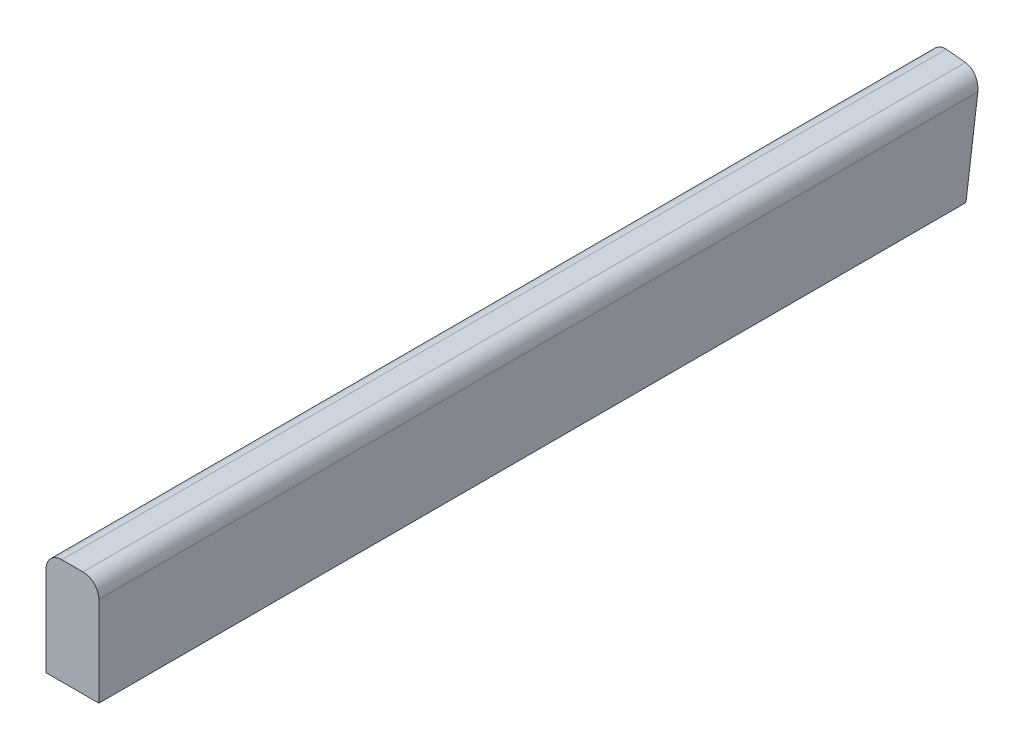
ISO-10303-21;
HEADER;
FILE_DESCRIPTION(('STEP AP214'),'2;1');
FILE_NAME('part.step','',(''),(''),'','','');
FILE_SCHEMA(('AUTOMOTIVE_DESIGN { 1 0 10303 214 1 1 1 1 }'));
ENDSEC;
DATA;
#1=APPLICATION_CONTEXT('core data for automotive mechanical design processes');
#2=APPLICATION_PROTOCOL_DEFINITION('international standard','automotive_design',2000,#1);
#3=PRODUCT_CONTEXT('',#1,'mechanical');
#4=PRODUCT('Part','Part','',(#3));
#5=PRODUCT_RELATED_PRODUCT_CATEGORY('part','',(#4));
#6=PRODUCT_DEFINITION_FORMATION('','',#4);
#7=PRODUCT_DEFINITION_CONTEXT('part definition',#1,'design');
#8=PRODUCT_DEFINITION('design','',#6,#7);
#9=PRODUCT_DEFINITION_SHAPE('','',#8);
#10=(LENGTH_UNIT() NAMED_UNIT(*) SI_UNIT(.MILLI.,.METRE.));
#11=(NAMED_UNIT(*) PLANE_ANGLE_UNIT() SI_UNIT($,.RADIAN.));
#12=(NAMED_UNIT(*) SI_UNIT($,.STERADIAN.) SOLID_ANGLE_UNIT());
#13=UNCERTAINTY_MEASURE_WITH_UNIT(LENGTH_MEASURE(1.E-05),#10,'distance_accuracy_value','');
#14=(GEOMETRIC_REPRESENTATION_CONTEXT(3) GLOBAL_UNCERTAINTY_ASSIGNED_CONTEXT((#13)) GLOBAL_UNIT_ASSIGNED_CONTEXT((#10,
#11,#12)) REPRESENTATION_CONTEXT('',''));
#15=CARTESIAN_POINT('',(0.,0.,0.));
#16=DIRECTION('',(0.,0.,1.));
#17=DIRECTION('',(1.,0.,0.));
#18=AXIS2_PLACEMENT_3D('',#15,#16,#17);
#19=CARTESIAN_POINT('',(0.,0.,-188.257777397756));
#20=DIRECTION('',(-1.,0.,0.));
#21=DIRECTION('',(0.,0.,1.));
#22=AXIS2_PLACEMENT_3D('',#19,#20,#21);
#23=PLANE('',#22);
#24=DIRECTION('',(0.,0.99138022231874,-0.13101623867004));
#25=VECTOR('',#24,1.);
#26=CARTESIAN_POINT('',(0.,3.03731969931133,-165.274834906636));
#27=LINE('',#26,#25);
#28=CARTESIAN_POINT('',(0.,0.,-164.873436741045));
#29=VERTEX_POINT('',#28);
#30=CARTESIAN_POINT('',(0.,17.,-167.120078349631));
#31=VERTEX_POINT('',#30);
#32=EDGE_CURVE('E41',#29,#31,#27,.T.);
#33=ORIENTED_EDGE('',*,*,#32,.F.);
#34=DIRECTION('',(0.,0.,1.));
#35=VECTOR('',#34,1.);
#36=CARTESIAN_POINT('',(0.,0.,-188.257777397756));
#37=LINE('',#36,#35);
#38=CARTESIAN_POINT('',(0.,0.,0.));
#39=VERTEX_POINT('',#38);
#40=EDGE_CURVE('E97',#29,#39,#37,.T.);
#41=ORIENTED_EDGE('',*,*,#40,.T.);
#42=DIRECTION('',(0.,-1.,0.));
#43=VECTOR('',#42,1.);
#44=CARTESIAN_POINT('',(0.,0.,0.));
#45=LINE('',#44,#43);
#46=CARTESIAN_POINT('',(0.,17.,0.));
#47=VERTEX_POINT('',#46);
#48=EDGE_CURVE('E122',#47,#39,#45,.T.);
#49=ORIENTED_EDGE('',*,*,#48,.F.);
#50=DIRECTION('',(0.,0.,1.));
#51=VECTOR('',#50,1.);
#52=CARTESIAN_POINT('',(0.,17.,-188.257777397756));
#53=LINE('',#52,#51);
#54=EDGE_CURVE('E90',#31,#47,#53,.T.);
#55=ORIENTED_EDGE('',*,*,#54,.F.);
#56=EDGE_LOOP('',(#33,#41,#49,#55));
#57=FACE_BOUND('',#56,.T.);
#58=ADVANCED_FACE('F33',(#57),#23,.T.);
#59=CARTESIAN_POINT('',(3.,17.,-188.257777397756));
#60=DIRECTION('',(0.,0.,1.));
#61=DIRECTION('',(1.,0.,0.));
#62=AXIS2_PLACEMENT_3D('',#59,#60,#61);
#63=CYLINDRICAL_SURFACE('',#62,3.);
#64=CARTESIAN_POINT('',(3.,17.,-166.857612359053));
#65=DIRECTION('',(-0.086410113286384,0.130526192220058,0.987672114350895));
#66=DIRECTION('',(0.545206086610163,-0.823557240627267,0.156536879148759));
#67=AXIS2_PLACEMENT_3D('',#64,#65,#66);
#68=ELLIPSE('',#67,3.03744527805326,3.);
#69=CARTESIAN_POINT('',(3.00000000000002,20.,-167.254078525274));
#70=VERTEX_POINT('',#69);
#71=EDGE_CURVE('E66',#31,#70,#68,.F.);
#72=ORIENTED_EDGE('',*,*,#71,.F.);
#73=ORIENTED_EDGE('',*,*,#54,.T.);
#74=CARTESIAN_POINT('',(3.,17.,0.));
#75=DIRECTION('',(0.,0.,1.));
#76=DIRECTION('',(-1.,0.,0.));
#77=AXIS2_PLACEMENT_3D('',#74,#75,#76);
#78=CIRCLE('',#77,3.);
#79=CARTESIAN_POINT('',(3.00000000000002,20.,0.));
#80=VERTEX_POINT('',#79);
#81=EDGE_CURVE('E99',#80,#47,#78,.T.);
#82=ORIENTED_EDGE('',*,*,#81,.F.);
#83=DIRECTION('',(0.,0.,1.));
#84=VECTOR('',#83,1.);
#85=CARTESIAN_POINT('',(3.00000000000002,20.,-188.257777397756));
#86=LINE('',#85,#84);
#87=EDGE_CURVE('E88',#70,#80,#86,.T.);
#88=ORIENTED_EDGE('',*,*,#87,.F.);
#89=EDGE_LOOP('',(#72,#73,#82,#88));
#90=FACE_BOUND('',#89,.T.);
#91=ADVANCED_FACE('F140',(#90),#63,.T.);
#92=CARTESIAN_POINT('',(3.00000000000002,20.,-188.257777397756));
#93=DIRECTION('',(0.,1.,0.));
#94=DIRECTION('',(0.,0.,1.));
#95=AXIS2_PLACEMENT_3D('',#92,#93,#94);
#96=PLANE('',#95);
#97=DIRECTION('',(0.996194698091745,0.,0.0871557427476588));
#98=VECTOR('',#97,1.);
#99=CARTESIAN_POINT('',(1.17637298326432,20.,-167.413625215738));
#100=LINE('',#99,#98);
#101=CARTESIAN_POINT('',(6.99999999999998,20.,-166.904123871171));
#102=VERTEX_POINT('',#101);
#103=EDGE_CURVE('E60',#70,#102,#100,.T.);
#104=ORIENTED_EDGE('',*,*,#103,.F.);
#105=ORIENTED_EDGE('',*,*,#87,.T.);
#106=DIRECTION('',(-1.,0.,0.));
#107=VECTOR('',#106,1.);
#108=CARTESIAN_POINT('',(3.00000000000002,20.,0.));
#109=LINE('',#108,#107);
#110=CARTESIAN_POINT('',(6.99999999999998,20.,0.));
#111=VERTEX_POINT('',#110);
#112=EDGE_CURVE('E86',#111,#80,#109,.T.);
#113=ORIENTED_EDGE('',*,*,#112,.F.);
#114=DIRECTION('',(0.,0.,1.));
#115=VECTOR('',#114,1.);
#116=CARTESIAN_POINT('',(6.99999999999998,20.,-188.257777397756));
#117=LINE('',#116,#115);
#118=EDGE_CURVE('E78',#102,#111,#117,.T.);
#119=ORIENTED_EDGE('',*,*,#118,.F.);
#120=EDGE_LOOP('',(#104,#105,#113,#119));
#121=FACE_BOUND('',#120,.T.);
#122=ADVANCED_FACE('F84',(#121),#96,.T.);
#123=CARTESIAN_POINT('',(7.,17.,-188.257777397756));
#124=DIRECTION('',(0.,0.,1.));
#125=DIRECTION('',(1.,0.,0.));
#126=AXIS2_PLACEMENT_3D('',#123,#124,#125);
#127=CYLINDRICAL_SURFACE('',#126,3.);
#128=CARTESIAN_POINT('',(7.,17.,-166.507657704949));
#129=DIRECTION('',(-0.086410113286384,0.130526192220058,0.987672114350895));
#130=DIRECTION('',(0.545206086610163,-0.823557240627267,0.156536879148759));
#131=AXIS2_PLACEMENT_3D('',#128,#129,#130);
#132=ELLIPSE('',#131,3.03744527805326,3.);
#133=CARTESIAN_POINT('',(10.,17.,-166.245191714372));
#134=VERTEX_POINT('',#133);
#135=EDGE_CURVE('E63',#102,#134,#132,.F.);
#136=ORIENTED_EDGE('',*,*,#135,.F.);
#137=ORIENTED_EDGE('',*,*,#118,.T.);
#138=CARTESIAN_POINT('',(7.,17.,0.));
#139=DIRECTION('',(0.,0.,1.));
#140=DIRECTION('',(1.,0.,0.));
#141=AXIS2_PLACEMENT_3D('',#138,#139,#140);
#142=CIRCLE('',#141,3.);
#143=CARTESIAN_POINT('',(10.,17.,0.));
#144=VERTEX_POINT('',#143);
#145=EDGE_CURVE('E111',#144,#111,#142,.T.);
#146=ORIENTED_EDGE('',*,*,#145,.F.);
#147=DIRECTION('',(0.,0.,1.));
#148=VECTOR('',#147,1.);
#149=CARTESIAN_POINT('',(10.,17.,-188.257777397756));
#150=LINE('',#149,#148);
#151=EDGE_CURVE('E81',#134,#144,#150,.T.);
#152=ORIENTED_EDGE('',*,*,#151,.F.);
#153=EDGE_LOOP('',(#136,#137,#146,#152));
#154=FACE_BOUND('',#153,.T.);
#155=ADVANCED_FACE('F75',(#154),#127,.T.);
#156=CARTESIAN_POINT('',(10.,0.,-188.257777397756));
#157=DIRECTION('',(1.,0.,0.));
#158=DIRECTION('',(0.,0.,-1.));
#159=AXIS2_PLACEMENT_3D('',#156,#157,#158);
#160=PLANE('',#159);
#161=DIRECTION('',(0.,-0.99138022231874,0.13101623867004));
#162=VECTOR('',#161,1.);
#163=CARTESIAN_POINT('',(10.,3.15095601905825,-164.414965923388));
#164=LINE('',#163,#162);
#165=CARTESIAN_POINT('',(10.,0.,-163.998550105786));
#166=VERTEX_POINT('',#165);
#167=EDGE_CURVE('E82',#134,#166,#164,.T.);
#168=ORIENTED_EDGE('',*,*,#167,.F.);
#169=ORIENTED_EDGE('',*,*,#151,.T.);
#170=DIRECTION('',(0.,1.,0.));
#171=VECTOR('',#170,1.);
#172=CARTESIAN_POINT('',(10.,0.,0.));
#173=LINE('',#172,#171);
#174=CARTESIAN_POINT('',(10.,0.,0.));
#175=VERTEX_POINT('',#174);
#176=EDGE_CURVE('E127',#175,#144,#173,.T.);
#177=ORIENTED_EDGE('',*,*,#176,.F.);
#178=DIRECTION('',(0.,0.,1.));
#179=VECTOR('',#178,1.);
#180=CARTESIAN_POINT('',(10.,0.,-188.257777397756));
#181=LINE('',#180,#179);
#182=EDGE_CURVE('E92',#166,#175,#181,.T.);
#183=ORIENTED_EDGE('',*,*,#182,.F.);
#184=EDGE_LOOP('',(#168,#169,#177,#183));
#185=FACE_BOUND('',#184,.T.);
#186=ADVANCED_FACE('F143',(#185),#160,.T.);
#187=CARTESIAN_POINT('',(0.,0.,-188.257777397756));
#188=DIRECTION('',(0.,-1.,0.));
#189=DIRECTION('',(0.,0.,-1.));
#190=AXIS2_PLACEMENT_3D('',#187,#188,#189);
#191=PLANE('',#190);
#192=DIRECTION('',(-0.996194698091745,0.,-0.0871557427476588));
#193=VECTOR('',#192,1.);
#194=CARTESIAN_POINT('',(-2.0303240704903,0.,-165.051067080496));
#195=LINE('',#194,#193);
#196=EDGE_CURVE('E11',#166,#29,#195,.T.);
#197=ORIENTED_EDGE('',*,*,#196,.F.);
#198=ORIENTED_EDGE('',*,*,#182,.T.);
#199=DIRECTION('',(1.,0.,0.));
#200=VECTOR('',#199,1.);
#201=CARTESIAN_POINT('',(0.,0.,0.));
#202=LINE('',#201,#200);
#203=EDGE_CURVE('E124',#39,#175,#202,.T.);
#204=ORIENTED_EDGE('',*,*,#203,.F.);
#205=ORIENTED_EDGE('',*,*,#40,.F.);
#206=EDGE_LOOP('',(#197,#198,#204,#205));
#207=FACE_BOUND('',#206,.T.);
#208=ADVANCED_FACE('F142',(#207),#191,.T.);
#209=CARTESIAN_POINT('',(3.,17.,0.));
#210=DIRECTION('',(0.,0.,-1.));
#211=DIRECTION('',(-1.,0.,0.));
#212=AXIS2_PLACEMENT_3D('',#209,#210,#211);
#213=PLANE('',#212);
#214=ORIENTED_EDGE('',*,*,#48,.T.);
#215=ORIENTED_EDGE('',*,*,#203,.T.);
#216=ORIENTED_EDGE('',*,*,#176,.T.);
#217=ORIENTED_EDGE('',*,*,#145,.T.);
#218=ORIENTED_EDGE('',*,*,#112,.T.);
#219=ORIENTED_EDGE('',*,*,#81,.T.);
#220=EDGE_LOOP('',(#214,#215,#216,#217,#218,#219));
#221=FACE_BOUND('',#220,.T.);
#222=ADVANCED_FACE('F129',(#221),#213,.F.);
#223=CARTESIAN_POINT('',(49.7513774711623,-5.84880387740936,-159.747804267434));
#224=DIRECTION('',(-0.086410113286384,0.130526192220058,0.987672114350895));
#225=DIRECTION('',(-0.0113761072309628,-0.991444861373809,0.130029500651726));
#226=AXIS2_PLACEMENT_3D('',#223,#224,#225);
#227=PLANE('',#226);
#228=ORIENTED_EDGE('',*,*,#32,.T.);
#229=ORIENTED_EDGE('',*,*,#71,.T.);
#230=ORIENTED_EDGE('',*,*,#103,.T.);
#231=ORIENTED_EDGE('',*,*,#135,.T.);
#232=ORIENTED_EDGE('',*,*,#167,.T.);
#233=ORIENTED_EDGE('',*,*,#196,.T.);
#234=EDGE_LOOP('',(#228,#229,#230,#231,#232,#233));
#235=FACE_BOUND('',#234,.T.);
#236=ADVANCED_FACE('F62',(#235),#227,.F.);
#237=CLOSED_SHELL('',(#58,#91,#122,#155,#186,#208,#222,#236));
#238=MANIFOLD_SOLID_BREP('B2',#237);
#239=ADVANCED_BREP_SHAPE_REPRESENTATION('',(#18,#238),#14);
#240=SHAPE_DEFINITION_REPRESENTATION(#9,#239);
ENDSEC;
END-ISO-10303-21;
